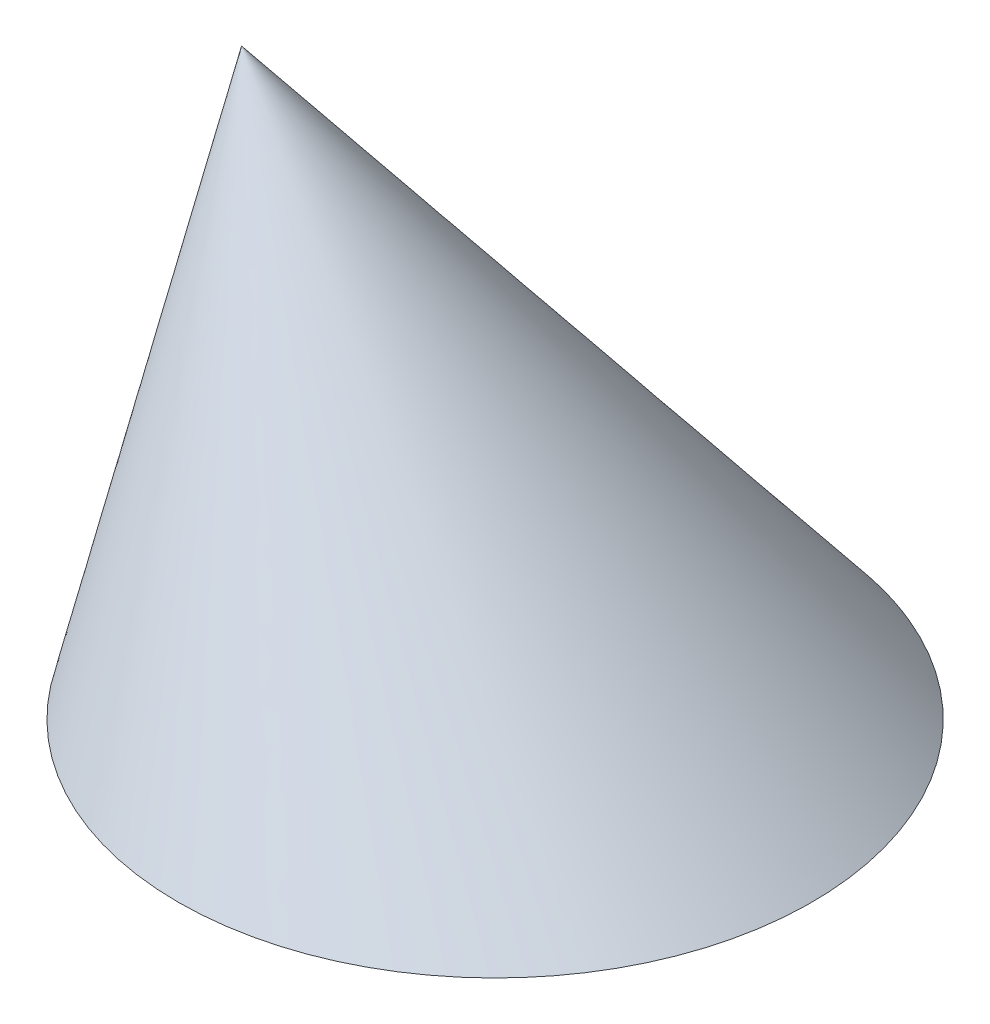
ISO-10303-21;
HEADER;
FILE_DESCRIPTION(('STEP AP214'),'2;1');
FILE_NAME('part.step','',(''),(''),'','','');
FILE_SCHEMA(('AUTOMOTIVE_DESIGN { 1 0 10303 214 1 1 1 1 }'));
ENDSEC;
DATA;
#1=APPLICATION_CONTEXT('core data for automotive mechanical design processes');
#2=APPLICATION_PROTOCOL_DEFINITION('international standard','automotive_design',2000,#1);
#3=PRODUCT_CONTEXT('',#1,'mechanical');
#4=PRODUCT('Part','Part','',(#3));
#5=PRODUCT_RELATED_PRODUCT_CATEGORY('part','',(#4));
#6=PRODUCT_DEFINITION_FORMATION('','',#4);
#7=PRODUCT_DEFINITION_CONTEXT('part definition',#1,'design');
#8=PRODUCT_DEFINITION('design','',#6,#7);
#9=PRODUCT_DEFINITION_SHAPE('','',#8);
#10=(LENGTH_UNIT() NAMED_UNIT(*) SI_UNIT(.MILLI.,.METRE.));
#11=(NAMED_UNIT(*) PLANE_ANGLE_UNIT() SI_UNIT($,.RADIAN.));
#12=(NAMED_UNIT(*) SI_UNIT($,.STERADIAN.) SOLID_ANGLE_UNIT());
#13=UNCERTAINTY_MEASURE_WITH_UNIT(LENGTH_MEASURE(1.E-05),#10,'distance_accuracy_value','');
#14=(GEOMETRIC_REPRESENTATION_CONTEXT(3) GLOBAL_UNCERTAINTY_ASSIGNED_CONTEXT((#13)) GLOBAL_UNIT_ASSIGNED_CONTEXT((#10,
#11,#12)) REPRESENTATION_CONTEXT('',''));
#15=CARTESIAN_POINT('',(0.,0.,0.));
#16=DIRECTION('',(0.,0.,1.));
#17=DIRECTION('',(1.,0.,0.));
#18=AXIS2_PLACEMENT_3D('',#15,#16,#17);
#19=CARTESIAN_POINT('',(0.,0.,0.));
#20=DIRECTION('',(0.,1.,0.));
#21=DIRECTION('',(0.,0.,1.));
#22=AXIS2_PLACEMENT_3D('',#19,#20,#21);
#23=PLANE('',#22);
#24=CARTESIAN_POINT('',(0.,0.,0.));
#25=DIRECTION('',(0.,1.,0.));
#26=DIRECTION('',(0.,0.,1.));
#27=AXIS2_PLACEMENT_3D('',#24,#25,#26);
#28=CIRCLE('',#27,250.);
#29=CARTESIAN_POINT('',(0.,0.,250.));
#30=VERTEX_POINT('',#29);
#31=EDGE_CURVE('E12',#30,#30,#28,.T.);
#32=ORIENTED_EDGE('',*,*,#31,.F.);
#33=EDGE_LOOP('',(#32));
#34=FACE_BOUND('',#33,.T.);
#35=ADVANCED_FACE('F39',(#34),#23,.F.);
#36=CARTESIAN_POINT('',(0.,0.,250.));
#37=CARTESIAN_POINT('',(-200.,360.,0.));
#38=CARTESIAN_POINT('',(4.08723730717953,0.,250.));
#39=CARTESIAN_POINT('',(-200.,360.,0.));
#40=CARTESIAN_POINT('',(8.32977502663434,0.,249.900166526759));
#41=CARTESIAN_POINT('',(-200.,360.,0.));
#42=CARTESIAN_POINT('',(17.1451748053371,0.,249.450438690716));
#43=CARTESIAN_POINT('',(-200.,360.,0.));
#44=CARTESIAN_POINT('',(21.7181032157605,0.,249.100599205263));
#45=CARTESIAN_POINT('',(-200.,360.,0.));
#46=CARTESIAN_POINT('',(31.2110918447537,0.,248.090008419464));
#47=CARTESIAN_POINT('',(-200.,360.,0.));
#48=CARTESIAN_POINT('',(36.1312462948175,0.,247.429311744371));
#49=CARTESIAN_POINT('',(-200.,360.,0.));
#50=CARTESIAN_POINT('',(46.3301074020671,0.,245.723935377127));
#51=CARTESIAN_POINT('',(-200.,360.,0.));
#52=CARTESIAN_POINT('',(51.6089442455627,0.,244.679302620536));
#53=CARTESIAN_POINT('',(-200.,360.,0.));
#54=CARTESIAN_POINT('',(62.5278696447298,0.,242.119205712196));
#55=CARTESIAN_POINT('',(-200.,360.,0.));
#56=CARTESIAN_POINT('',(68.1681326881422,0.,240.603768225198));
#57=CARTESIAN_POINT('',(-200.,360.,0.));
#58=CARTESIAN_POINT('',(79.7993511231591,0.,237.000276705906));
#59=CARTESIAN_POINT('',(-200.,360.,0.));
#60=CARTESIAN_POINT('',(85.7905319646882,0.,234.912209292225));
#61=CARTESIAN_POINT('',(-200.,360.,0.));
#62=CARTESIAN_POINT('',(98.0937913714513,0.,230.0464508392));
#63=CARTESIAN_POINT('',(-200.,360.,0.));
#64=CARTESIAN_POINT('',(104.406147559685,0.,227.268677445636));
#65=CARTESIAN_POINT('',(-200.,360.,0.));
#66=CARTESIAN_POINT('',(117.29517788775,0.,220.892590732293));
#67=CARTESIAN_POINT('',(-200.,360.,0.));
#68=CARTESIAN_POINT('',(123.87217125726,0.,217.294087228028));
#69=CARTESIAN_POINT('',(-200.,360.,0.));
#70=CARTESIAN_POINT('',(137.198100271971,0.,209.13564124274));
#71=CARTESIAN_POINT('',(-200.,360.,0.));
#72=CARTESIAN_POINT('',(143.947365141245,0.,204.575354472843));
#73=CARTESIAN_POINT('',(-200.,360.,0.));
#74=CARTESIAN_POINT('',(157.479787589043,0.,194.350292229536));
#75=CARTESIAN_POINT('',(-200.,360.,0.));
#76=CARTESIAN_POINT('',(164.263220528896,0.,188.684973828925));
#77=CARTESIAN_POINT('',(-200.,360.,0.));
#78=CARTESIAN_POINT('',(177.670898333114,0.,176.117792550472));
#79=CARTESIAN_POINT('',(-200.,360.,0.));
#80=CARTESIAN_POINT('',(184.295259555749,0.,169.215165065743));
#81=CARTESIAN_POINT('',(-200.,360.,0.));
#82=CARTESIAN_POINT('',(197.130351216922,0.,154.071864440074));
#83=CARTESIAN_POINT('',(-200.,360.,0.));
#84=CARTESIAN_POINT('',(203.340894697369,0.,145.830235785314));
#85=CARTESIAN_POINT('',(-200.,360.,0.));
#86=CARTESIAN_POINT('',(215.033010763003,0.,127.963984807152));
#87=CARTESIAN_POINT('',(-200.,360.,0.));
#88=CARTESIAN_POINT('',(220.513936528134,0.,118.33834006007));
#89=CARTESIAN_POINT('',(-200.,360.,0.));
#90=CARTESIAN_POINT('',(230.382490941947,0.,97.7459298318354));
#91=CARTESIAN_POINT('',(-200.,360.,0.));
#92=CARTESIAN_POINT('',(234.768907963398,0.,86.778318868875));
#93=CARTESIAN_POINT('',(-200.,360.,0.));
#94=CARTESIAN_POINT('',(240.23925310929,0.,69.4394013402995));
#95=CARTESIAN_POINT('',(-200.,360.,0.));
#96=CARTESIAN_POINT('',(241.877772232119,0.,63.5128352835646));
#97=CARTESIAN_POINT('',(-200.,360.,0.));
#98=CARTESIAN_POINT('',(244.738552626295,0.,51.3982276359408));
#99=CARTESIAN_POINT('',(-200.,360.,0.));
#100=CARTESIAN_POINT('',(245.960753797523,0.,45.2101877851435));
#101=CARTESIAN_POINT('',(-200.,360.,0.));
#102=CARTESIAN_POINT('',(247.945573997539,0.,32.6135834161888));
#103=CARTESIAN_POINT('',(-200.,360.,0.));
#104=CARTESIAN_POINT('',(248.708130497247,0.,26.2050352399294));
#105=CARTESIAN_POINT('',(-200.,360.,0.));
#106=CARTESIAN_POINT('',(249.73537394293,0.,13.2166958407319));
#107=CARTESIAN_POINT('',(-200.,360.,0.));
#108=CARTESIAN_POINT('',(250.,0.,6.63693690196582));
#109=CARTESIAN_POINT('',(-200.,360.,0.));
#110=CARTESIAN_POINT('',(250.,0.,-6.63693690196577));
#111=CARTESIAN_POINT('',(-200.,360.,0.));
#112=CARTESIAN_POINT('',(249.73537394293,0.,-13.2166958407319));
#113=CARTESIAN_POINT('',(-200.,360.,0.));
#114=CARTESIAN_POINT('',(248.708130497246,0.,-26.2050352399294));
#115=CARTESIAN_POINT('',(-200.,360.,0.));
#116=CARTESIAN_POINT('',(247.945573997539,0.,-32.6135834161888));
#117=CARTESIAN_POINT('',(-200.,360.,0.));
#118=CARTESIAN_POINT('',(245.960753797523,0.,-45.2101877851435));
#119=CARTESIAN_POINT('',(-200.,360.,0.));
#120=CARTESIAN_POINT('',(244.738552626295,0.,-51.3982276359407));
#121=CARTESIAN_POINT('',(-200.,360.,0.));
#122=CARTESIAN_POINT('',(241.877772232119,0.,-63.5128352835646));
#123=CARTESIAN_POINT('',(-200.,360.,0.));
#124=CARTESIAN_POINT('',(240.23925310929,0.,-69.4394013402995));
#125=CARTESIAN_POINT('',(-200.,360.,0.));
#126=CARTESIAN_POINT('',(234.768907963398,0.,-86.7783188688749));
#127=CARTESIAN_POINT('',(-200.,360.,0.));
#128=CARTESIAN_POINT('',(230.382490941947,0.,-97.7459298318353));
#129=CARTESIAN_POINT('',(-200.,360.,0.));
#130=CARTESIAN_POINT('',(220.513936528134,0.,-118.33834006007));
#131=CARTESIAN_POINT('',(-200.,360.,0.));
#132=CARTESIAN_POINT('',(215.033010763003,0.,-127.963984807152));
#133=CARTESIAN_POINT('',(-200.,360.,0.));
#134=CARTESIAN_POINT('',(203.340894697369,0.,-145.830235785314));
#135=CARTESIAN_POINT('',(-200.,360.,0.));
#136=CARTESIAN_POINT('',(197.130351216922,0.,-154.071864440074));
#137=CARTESIAN_POINT('',(-200.,360.,0.));
#138=CARTESIAN_POINT('',(184.295259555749,0.,-169.215165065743));
#139=CARTESIAN_POINT('',(-200.,360.,0.));
#140=CARTESIAN_POINT('',(177.670898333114,0.,-176.117792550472));
#141=CARTESIAN_POINT('',(-200.,360.,0.));
#142=CARTESIAN_POINT('',(164.263220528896,0.,-188.684973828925));
#143=CARTESIAN_POINT('',(-200.,360.,0.));
#144=CARTESIAN_POINT('',(157.479787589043,0.,-194.350292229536));
#145=CARTESIAN_POINT('',(-200.,360.,0.));
#146=CARTESIAN_POINT('',(143.947365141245,0.,-204.575354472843));
#147=CARTESIAN_POINT('',(-200.,360.,0.));
#148=CARTESIAN_POINT('',(137.198100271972,0.,-209.13564124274));
#149=CARTESIAN_POINT('',(-200.,360.,0.));
#150=CARTESIAN_POINT('',(123.87217125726,0.,-217.294087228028));
#151=CARTESIAN_POINT('',(-200.,360.,0.));
#152=CARTESIAN_POINT('',(117.29517788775,0.,-220.892590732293));
#153=CARTESIAN_POINT('',(-200.,360.,0.));
#154=CARTESIAN_POINT('',(104.406147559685,0.,-227.268677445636));
#155=CARTESIAN_POINT('',(-200.,360.,0.));
#156=CARTESIAN_POINT('',(98.0937913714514,0.,-230.0464508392));
#157=CARTESIAN_POINT('',(-200.,360.,0.));
#158=CARTESIAN_POINT('',(85.7905319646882,0.,-234.912209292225));
#159=CARTESIAN_POINT('',(-200.,360.,0.));
#160=CARTESIAN_POINT('',(79.7993511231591,0.,-237.000276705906));
#161=CARTESIAN_POINT('',(-200.,360.,0.));
#162=CARTESIAN_POINT('',(68.1681326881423,0.,-240.603768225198));
#163=CARTESIAN_POINT('',(-200.,360.,0.));
#164=CARTESIAN_POINT('',(62.5278696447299,0.,-242.119205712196));
#165=CARTESIAN_POINT('',(-200.,360.,0.));
#166=CARTESIAN_POINT('',(51.6089442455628,0.,-244.679302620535));
#167=CARTESIAN_POINT('',(-200.,360.,0.));
#168=CARTESIAN_POINT('',(46.3301074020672,0.,-245.723935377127));
#169=CARTESIAN_POINT('',(-200.,360.,0.));
#170=CARTESIAN_POINT('',(36.1312462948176,0.,-247.429311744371));
#171=CARTESIAN_POINT('',(-200.,360.,0.));
#172=CARTESIAN_POINT('',(31.2110918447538,0.,-248.090008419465));
#173=CARTESIAN_POINT('',(-200.,360.,0.));
#174=CARTESIAN_POINT('',(21.7181032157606,0.,-249.100599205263));
#175=CARTESIAN_POINT('',(-200.,360.,0.));
#176=CARTESIAN_POINT('',(17.1451748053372,0.,-249.450438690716));
#177=CARTESIAN_POINT('',(-200.,360.,0.));
#178=CARTESIAN_POINT('',(8.32977502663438,0.,-249.900166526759));
#179=CARTESIAN_POINT('',(-200.,360.,0.));
#180=CARTESIAN_POINT('',(4.08723730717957,0.,-250.));
#181=CARTESIAN_POINT('',(-200.,360.,0.));
#182=CARTESIAN_POINT('',(-4.08723730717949,0.,-250.));
#183=CARTESIAN_POINT('',(-200.,360.,0.));
#184=CARTESIAN_POINT('',(-8.3297750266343,0.,-249.900166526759));
#185=CARTESIAN_POINT('',(-200.,360.,0.));
#186=CARTESIAN_POINT('',(-17.1451748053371,0.,-249.450438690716));
#187=CARTESIAN_POINT('',(-200.,360.,0.));
#188=CARTESIAN_POINT('',(-21.7181032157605,0.,-249.100599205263));
#189=CARTESIAN_POINT('',(-200.,360.,0.));
#190=CARTESIAN_POINT('',(-31.2110918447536,0.,-248.090008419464));
#191=CARTESIAN_POINT('',(-200.,360.,0.));
#192=CARTESIAN_POINT('',(-36.1312462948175,0.,-247.429311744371));
#193=CARTESIAN_POINT('',(-200.,360.,0.));
#194=CARTESIAN_POINT('',(-46.3301074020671,0.,-245.723935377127));
#195=CARTESIAN_POINT('',(-200.,360.,0.));
#196=CARTESIAN_POINT('',(-51.6089442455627,0.,-244.679302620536));
#197=CARTESIAN_POINT('',(-200.,360.,0.));
#198=CARTESIAN_POINT('',(-62.5278696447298,0.,-242.119205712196));
#199=CARTESIAN_POINT('',(-200.,360.,0.));
#200=CARTESIAN_POINT('',(-68.1681326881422,0.,-240.603768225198));
#201=CARTESIAN_POINT('',(-200.,360.,0.));
#202=CARTESIAN_POINT('',(-79.799351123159,0.,-237.000276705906));
#203=CARTESIAN_POINT('',(-200.,360.,0.));
#204=CARTESIAN_POINT('',(-85.7905319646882,0.,-234.912209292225));
#205=CARTESIAN_POINT('',(-200.,360.,0.));
#206=CARTESIAN_POINT('',(-98.0937913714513,0.,-230.0464508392));
#207=CARTESIAN_POINT('',(-200.,360.,0.));
#208=CARTESIAN_POINT('',(-104.406147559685,0.,-227.268677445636));
#209=CARTESIAN_POINT('',(-200.,360.,0.));
#210=CARTESIAN_POINT('',(-117.29517788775,0.,-220.892590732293));
#211=CARTESIAN_POINT('',(-200.,360.,0.));
#212=CARTESIAN_POINT('',(-123.87217125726,0.,-217.294087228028));
#213=CARTESIAN_POINT('',(-200.,360.,0.));
#214=CARTESIAN_POINT('',(-137.198100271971,0.,-209.13564124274));
#215=CARTESIAN_POINT('',(-200.,360.,0.));
#216=CARTESIAN_POINT('',(-143.947365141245,0.,-204.575354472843));
#217=CARTESIAN_POINT('',(-200.,360.,0.));
#218=CARTESIAN_POINT('',(-157.479787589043,0.,-194.350292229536));
#219=CARTESIAN_POINT('',(-200.,360.,0.));
#220=CARTESIAN_POINT('',(-164.263220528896,0.,-188.684973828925));
#221=CARTESIAN_POINT('',(-200.,360.,0.));
#222=CARTESIAN_POINT('',(-177.670898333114,0.,-176.117792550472));
#223=CARTESIAN_POINT('',(-200.,360.,0.));
#224=CARTESIAN_POINT('',(-184.295259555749,0.,-169.215165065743));
#225=CARTESIAN_POINT('',(-200.,360.,0.));
#226=CARTESIAN_POINT('',(-197.130351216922,0.,-154.071864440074));
#227=CARTESIAN_POINT('',(-200.,360.,0.));
#228=CARTESIAN_POINT('',(-203.340894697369,0.,-145.830235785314));
#229=CARTESIAN_POINT('',(-200.,360.,0.));
#230=CARTESIAN_POINT('',(-215.033010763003,0.,-127.963984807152));
#231=CARTESIAN_POINT('',(-200.,360.,0.));
#232=CARTESIAN_POINT('',(-220.513936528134,0.,-118.33834006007));
#233=CARTESIAN_POINT('',(-200.,360.,0.));
#234=CARTESIAN_POINT('',(-230.382490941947,0.,-97.7459298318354));
#235=CARTESIAN_POINT('',(-200.,360.,0.));
#236=CARTESIAN_POINT('',(-234.768907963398,0.,-86.778318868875));
#237=CARTESIAN_POINT('',(-200.,360.,0.));
#238=CARTESIAN_POINT('',(-240.23925310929,0.,-69.4394013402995));
#239=CARTESIAN_POINT('',(-200.,360.,0.));
#240=CARTESIAN_POINT('',(-241.877772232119,0.,-63.5128352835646));
#241=CARTESIAN_POINT('',(-200.,360.,0.));
#242=CARTESIAN_POINT('',(-244.738552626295,0.,-51.3982276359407));
#243=CARTESIAN_POINT('',(-200.,360.,0.));
#244=CARTESIAN_POINT('',(-245.960753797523,0.,-45.2101877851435));
#245=CARTESIAN_POINT('',(-200.,360.,0.));
#246=CARTESIAN_POINT('',(-247.945573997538,0.,-32.6135834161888));
#247=CARTESIAN_POINT('',(-200.,360.,0.));
#248=CARTESIAN_POINT('',(-248.708130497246,0.,-26.2050352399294));
#249=CARTESIAN_POINT('',(-200.,360.,0.));
#250=CARTESIAN_POINT('',(-249.73537394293,0.,-13.2166958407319));
#251=CARTESIAN_POINT('',(-200.,360.,0.));
#252=CARTESIAN_POINT('',(-250.,0.,-6.63693690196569));
#253=CARTESIAN_POINT('',(-200.,360.,0.));
#254=CARTESIAN_POINT('',(-250.,0.,6.63693690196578));
#255=CARTESIAN_POINT('',(-200.,360.,0.));
#256=CARTESIAN_POINT('',(-249.73537394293,0.,13.2166958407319));
#257=CARTESIAN_POINT('',(-200.,360.,0.));
#258=CARTESIAN_POINT('',(-248.708130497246,0.,26.2050352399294));
#259=CARTESIAN_POINT('',(-200.,360.,0.));
#260=CARTESIAN_POINT('',(-247.945573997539,0.,32.6135834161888));
#261=CARTESIAN_POINT('',(-200.,360.,0.));
#262=CARTESIAN_POINT('',(-245.960753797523,0.,45.2101877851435));
#263=CARTESIAN_POINT('',(-200.,360.,0.));
#264=CARTESIAN_POINT('',(-244.738552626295,0.,51.3982276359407));
#265=CARTESIAN_POINT('',(-200.,360.,0.));
#266=CARTESIAN_POINT('',(-241.877772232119,0.,63.5128352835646));
#267=CARTESIAN_POINT('',(-200.,360.,0.));
#268=CARTESIAN_POINT('',(-240.23925310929,0.,69.4394013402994));
#269=CARTESIAN_POINT('',(-200.,360.,0.));
#270=CARTESIAN_POINT('',(-234.768907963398,0.,86.7783188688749));
#271=CARTESIAN_POINT('',(-200.,360.,0.));
#272=CARTESIAN_POINT('',(-230.382490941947,0.,97.7459298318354));
#273=CARTESIAN_POINT('',(-200.,360.,0.));
#274=CARTESIAN_POINT('',(-220.513936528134,0.,118.33834006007));
#275=CARTESIAN_POINT('',(-200.,360.,0.));
#276=CARTESIAN_POINT('',(-215.033010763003,0.,127.963984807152));
#277=CARTESIAN_POINT('',(-200.,360.,0.));
#278=CARTESIAN_POINT('',(-203.340894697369,0.,145.830235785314));
#279=CARTESIAN_POINT('',(-200.,360.,0.));
#280=CARTESIAN_POINT('',(-197.130351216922,0.,154.071864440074));
#281=CARTESIAN_POINT('',(-200.,360.,0.));
#282=CARTESIAN_POINT('',(-184.295259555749,0.,169.215165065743));
#283=CARTESIAN_POINT('',(-200.,360.,0.));
#284=CARTESIAN_POINT('',(-177.670898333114,0.,176.117792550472));
#285=CARTESIAN_POINT('',(-200.,360.,0.));
#286=CARTESIAN_POINT('',(-164.263220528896,0.,188.684973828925));
#287=CARTESIAN_POINT('',(-200.,360.,0.));
#288=CARTESIAN_POINT('',(-157.479787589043,0.,194.350292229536));
#289=CARTESIAN_POINT('',(-200.,360.,0.));
#290=CARTESIAN_POINT('',(-143.947365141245,0.,204.575354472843));
#291=CARTESIAN_POINT('',(-200.,360.,0.));
#292=CARTESIAN_POINT('',(-137.198100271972,0.,209.13564124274));
#293=CARTESIAN_POINT('',(-200.,360.,0.));
#294=CARTESIAN_POINT('',(-123.87217125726,0.,217.294087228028));
#295=CARTESIAN_POINT('',(-200.,360.,0.));
#296=CARTESIAN_POINT('',(-117.29517788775,0.,220.892590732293));
#297=CARTESIAN_POINT('',(-200.,360.,0.));
#298=CARTESIAN_POINT('',(-104.406147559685,0.,227.268677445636));
#299=CARTESIAN_POINT('',(-200.,360.,0.));
#300=CARTESIAN_POINT('',(-98.0937913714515,0.,230.0464508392));
#301=CARTESIAN_POINT('',(-200.,360.,0.));
#302=CARTESIAN_POINT('',(-85.7905319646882,0.,234.912209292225));
#303=CARTESIAN_POINT('',(-200.,360.,0.));
#304=CARTESIAN_POINT('',(-79.7993511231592,0.,237.000276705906));
#305=CARTESIAN_POINT('',(-200.,360.,0.));
#306=CARTESIAN_POINT('',(-68.1681326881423,0.,240.603768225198));
#307=CARTESIAN_POINT('',(-200.,360.,0.));
#308=CARTESIAN_POINT('',(-62.5278696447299,0.,242.119205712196));
#309=CARTESIAN_POINT('',(-200.,360.,0.));
#310=CARTESIAN_POINT('',(-51.6089442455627,0.,244.679302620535));
#311=CARTESIAN_POINT('',(-200.,360.,0.));
#312=CARTESIAN_POINT('',(-46.3301074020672,0.,245.723935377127));
#313=CARTESIAN_POINT('',(-200.,360.,0.));
#314=CARTESIAN_POINT('',(-36.1312462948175,0.,247.429311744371));
#315=CARTESIAN_POINT('',(-200.,360.,0.));
#316=CARTESIAN_POINT('',(-31.2110918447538,0.,248.090008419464));
#317=CARTESIAN_POINT('',(-200.,360.,0.));
#318=CARTESIAN_POINT('',(-21.7181032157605,0.,249.100599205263));
#319=CARTESIAN_POINT('',(-200.,360.,0.));
#320=CARTESIAN_POINT('',(-17.1451748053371,0.,249.450438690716));
#321=CARTESIAN_POINT('',(-200.,360.,0.));
#322=CARTESIAN_POINT('',(-8.32977502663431,0.,249.900166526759));
#323=CARTESIAN_POINT('',(-200.,360.,0.));
#324=CARTESIAN_POINT('',(-4.0872373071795,0.,250.));
#325=CARTESIAN_POINT('',(-200.,360.,0.));
#326=CARTESIAN_POINT('',(0.,0.,250.));
#327=CARTESIAN_POINT('',(-200.,360.,0.));
#328=B_SPLINE_SURFACE_WITH_KNOTS('',3,1,((#36,#37),(#38,#39),(#40,#41),(#42,#43),(#44,#45),(#46,
#47),(#48,#49),(#50,#51),(#52,#53),(#54,#55),(#56,#57),(#58,#59),(#60,#61),(#62,#63),(#64,#65),
(#66,#67),(#68,#69),(#70,#71),(#72,#73),(#74,#75),(#76,#77),(#78,#79),(#80,#81),(#82,#83),(#84,
#85),(#86,#87),(#88,#89),(#90,#91),(#92,#93),(#94,#95),(#96,#97),(#98,#99),(#100,#101),(#102,
#103),(#104,#105),(#106,#107),(#108,#109),(#110,#111),(#112,#113),(#114,#115),(#116,#117),(#118,
#119),(#120,#121),(#122,#123),(#124,#125),(#126,#127),(#128,#129),(#130,#131),(#132,#133),(#134,
#135),(#136,#137),(#138,#139),(#140,#141),(#142,#143),(#144,#145),(#146,#147),(#148,#149),(#150,
#151),(#152,#153),(#154,#155),(#156,#157),(#158,#159),(#160,#161),(#162,#163),(#164,#165),(#166,
#167),(#168,#169),(#170,#171),(#172,#173),(#174,#175),(#176,#177),(#178,#179),(#180,#181),(#182,
#183),(#184,#185),(#186,#187),(#188,#189),(#190,#191),(#192,#193),(#194,#195),(#196,#197),(#198,
#199),(#200,#201),(#202,#203),(#204,#205),(#206,#207),(#208,#209),(#210,#211),(#212,#213),(#214,
#215),(#216,#217),(#218,#219),(#220,#221),(#222,#223),(#224,#225),(#226,#227),(#228,#229),(#230,
#231),(#232,#233),(#234,#235),(#236,#237),(#238,#239),(#240,#241),(#242,#243),(#244,#245),(#246,
#247),(#248,#249),(#250,#251),(#252,#253),(#254,#255),(#256,#257),(#258,#259),(#260,#261),(#262,
#263),(#264,#265),(#266,#267),(#268,#269),(#270,#271),(#272,#273),(#274,#275),(#276,#277),(#278,
#279),(#280,#281),(#282,#283),(#284,#285),(#286,#287),(#288,#289),(#290,#291),(#292,#293),(#294,
#295),(#296,#297),(#298,#299),(#300,#301),(#302,#303),(#304,#305),(#306,#307),(#308,#309),(#310,
#311),(#312,#313),(#314,#315),(#316,#317),(#318,#319),(#320,#321),(#322,#323),(#324,#325),(#326,
#327)),.UNSPECIFIED.,.T.,.F.,.F.,(4,2,2,2,2,2,2,2,2,2,2,2,2,2,2,2,2,2,2,2,2,2,2,2,2,2,2,2,2,2,2,
2,2,2,2,2,2,2,2,2,2,2,2,2,2,2,2,2,2,2,2,2,2,2,2,2,2,2,2,2,2,2,2,2,2,2,2,2,2,2,2,2,4),(2,2),(0.,
0.015625,0.03125,0.046875,0.0625,0.078125,0.09375,0.109375,0.125,0.140625,0.15625,0.171875,
0.1875,0.203125,0.21875,0.2265625,0.234375,0.2421875,0.25,0.2578125,0.265625,0.2734375,0.28125,
0.296875,0.3125,0.328125,0.34375,0.359375,0.375,0.390625,0.40625,0.421875,0.4375,0.453125,
0.46875,0.484375,0.5,0.515625,0.53125,0.546875,0.5625,0.578125,0.59375,0.609375,0.625,0.640625,
0.65625,0.671875,0.6875,0.703125,0.71875,0.7265625,0.734375,0.7421875,0.75,0.7578125,0.765625,
0.7734375,0.78125,0.796875,0.8125,0.828125,0.84375,0.859375,0.875,0.890625,0.90625,0.921875,
0.9375,0.953125,0.96875,0.984375,1.),(0.,1.),.UNSPECIFIED.);
#329=CARTESIAN_POINT('',(-200.,360.,0.));
#330=VERTEX_POINT('',#329);
#331=VERTEX_LOOP('',#330);
#332=FACE_BOUND('',#331,.T.);
#333=ORIENTED_EDGE('',*,*,#31,.T.);
#334=EDGE_LOOP('',(#333));
#335=FACE_BOUND('',#334,.T.);
#336=ADVANCED_FACE('F41',(#332,#335),#328,.T.);
#337=CLOSED_SHELL('',(#35,#336));
#338=MANIFOLD_SOLID_BREP('B2',#337);
#339=ADVANCED_BREP_SHAPE_REPRESENTATION('',(#18,#338),#14);
#340=SHAPE_DEFINITION_REPRESENTATION(#9,#339);
ENDSEC;
END-ISO-10303-21;
